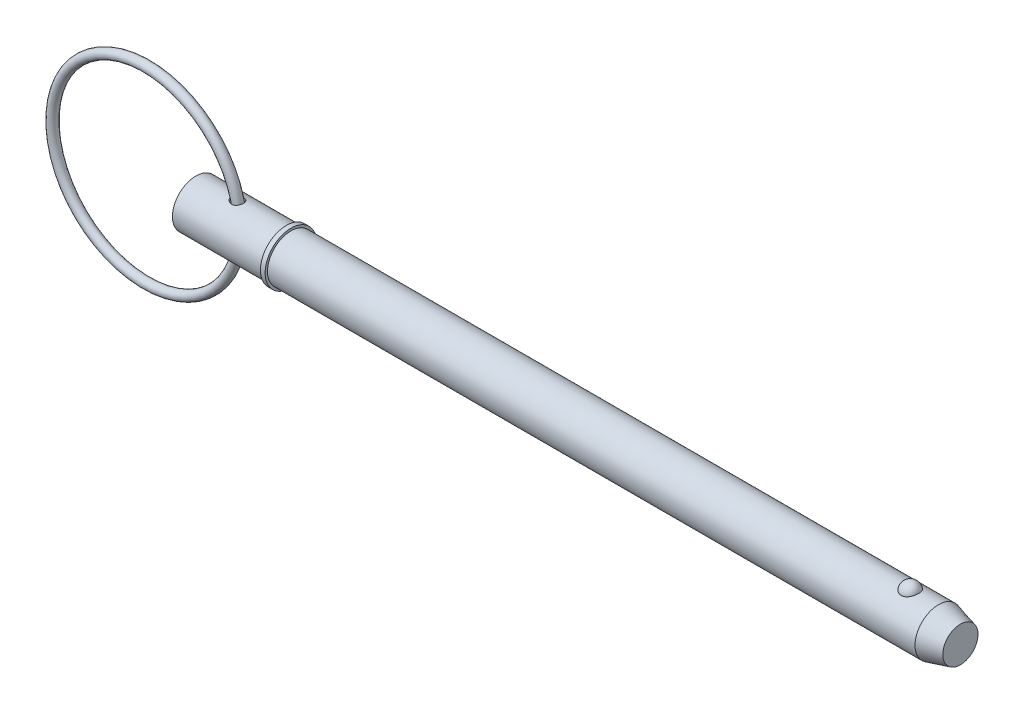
ISO-10303-21;
HEADER;
FILE_DESCRIPTION(('STEP AP214'),'2;1');
FILE_NAME('part.step','',(''),(''),'','','');
FILE_SCHEMA(('AUTOMOTIVE_DESIGN { 1 0 10303 214 1 1 1 1 }'));
ENDSEC;
DATA;
#1=APPLICATION_CONTEXT('core data for automotive mechanical design processes');
#2=APPLICATION_PROTOCOL_DEFINITION('international standard','automotive_design',2000,#1);
#3=PRODUCT_CONTEXT('',#1,'mechanical');
#4=PRODUCT('Part','Part','',(#3));
#5=PRODUCT_RELATED_PRODUCT_CATEGORY('part','',(#4));
#6=PRODUCT_DEFINITION_FORMATION('','',#4);
#7=PRODUCT_DEFINITION_CONTEXT('part definition',#1,'design');
#8=PRODUCT_DEFINITION('design','',#6,#7);
#9=PRODUCT_DEFINITION_SHAPE('','',#8);
#10=(LENGTH_UNIT() NAMED_UNIT(*) SI_UNIT(.MILLI.,.METRE.));
#11=(NAMED_UNIT(*) PLANE_ANGLE_UNIT() SI_UNIT($,.RADIAN.));
#12=(NAMED_UNIT(*) SI_UNIT($,.STERADIAN.) SOLID_ANGLE_UNIT());
#13=UNCERTAINTY_MEASURE_WITH_UNIT(LENGTH_MEASURE(1.E-05),#10,'distance_accuracy_value','');
#14=(GEOMETRIC_REPRESENTATION_CONTEXT(3) GLOBAL_UNCERTAINTY_ASSIGNED_CONTEXT((#13)) GLOBAL_UNIT_ASSIGNED_CONTEXT((#10,
#11,#12)) REPRESENTATION_CONTEXT('',''));
#15=CARTESIAN_POINT('',(0.,0.,0.));
#16=DIRECTION('',(0.,0.,1.));
#17=DIRECTION('',(1.,0.,0.));
#18=AXIS2_PLACEMENT_3D('',#15,#16,#17);
#19=CARTESIAN_POINT('',(-13.3798047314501,0.,0.));
#20=DIRECTION('',(0.,0.,1.));
#21=DIRECTION('',(1.,0.,0.));
#22=AXIS2_PLACEMENT_3D('',#19,#20,#21);
#23=TOROIDAL_SURFACE('',#22,25.4,1.27);
#24=CARTESIAN_POINT('',(13.2901952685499,0.,0.));
#25=VERTEX_POINT('',#24);
#26=VERTEX_LOOP('',#25);
#27=FACE_BOUND('',#26,.T.);
#28=ADVANCED_FACE('P0_F12',(#27),#23,.T.);
#29=CLOSED_SHELL('',(#28));
#30=MANIFOLD_SOLID_BREP('P0_B1',#29);
#31=CARTESIAN_POINT('',(0.,0.,0.));
#32=DIRECTION('',(1.,0.,0.));
#33=DIRECTION('',(0.,0.,-1.));
#34=AXIS2_PLACEMENT_3D('',#31,#32,#33);
#35=CYLINDRICAL_SURFACE('',#34,6.35);
#36=CARTESIAN_POINT('',(9.67500140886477,6.32698634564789,-0.540133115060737));
#37=CARTESIAN_POINT('',(9.70878953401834,6.3197498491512,-0.624879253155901));
#38=CARTESIAN_POINT('',(9.75028044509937,6.31105328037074,-0.706504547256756));
#39=CARTESIAN_POINT('',(9.84659255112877,6.29180070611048,-0.861319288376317));
#40=CARTESIAN_POINT('',(9.90144039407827,6.28124099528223,-0.934491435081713));
#41=CARTESIAN_POINT('',(10.021999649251,6.25949497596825,-1.0704877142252));
#42=CARTESIAN_POINT('',(10.0876589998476,6.2483118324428,-1.13335868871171));
#43=CARTESIAN_POINT('',(10.2280180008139,6.22641783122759,-1.24805262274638));
#44=CARTESIAN_POINT('',(10.3027159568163,6.21570688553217,-1.29987764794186));
#45=CARTESIAN_POINT('',(10.4650889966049,6.19509606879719,-1.39492899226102));
#46=CARTESIAN_POINT('',(10.5533142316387,6.1853135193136,-1.4372443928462));
#47=CARTESIAN_POINT('',(10.7357818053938,6.16871128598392,-1.50691441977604));
#48=CARTESIAN_POINT('',(10.8300253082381,6.16189217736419,-1.53426614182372));
#49=CARTESIAN_POINT('',(11.0227953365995,6.15211299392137,-1.57302798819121));
#50=CARTESIAN_POINT('',(11.1213511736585,6.14918579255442,-1.58430237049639));
#51=CARTESIAN_POINT('',(11.3189518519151,6.1478413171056,-1.58951619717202));
#52=CARTESIAN_POINT('',(11.417996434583,6.14942187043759,-1.58346399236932));
#53=CARTESIAN_POINT('',(11.6070859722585,6.15678569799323,-1.55457003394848));
#54=CARTESIAN_POINT('',(11.6973059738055,6.16229943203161,-1.53280404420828));
#55=CARTESIAN_POINT('',(11.8723373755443,6.17663058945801,-1.4739892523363));
#56=CARTESIAN_POINT('',(11.9571502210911,6.185447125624,-1.43694455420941));
#57=CARTESIAN_POINT('',(12.1146737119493,6.20482821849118,-1.35072170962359));
#58=CARTESIAN_POINT('',(12.1877743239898,6.21528554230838,-1.30222952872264));
#59=CARTESIAN_POINT('',(12.3246187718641,6.23705116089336,-1.19362916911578));
#60=CARTESIAN_POINT('',(12.3883628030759,6.24835943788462,-1.1335212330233));
#61=CARTESIAN_POINT('',(12.5046662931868,6.27053957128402,-1.00357204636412));
#62=CARTESIAN_POINT('',(12.5572571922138,6.28141258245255,-0.933759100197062));
#63=CARTESIAN_POINT('',(12.6502125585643,6.30157953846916,-0.786214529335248));
#64=CARTESIAN_POINT('',(12.6905764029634,6.31087340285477,-0.708482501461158));
#65=CARTESIAN_POINT('',(12.7585531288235,6.32699259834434,-0.546246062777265));
#66=CARTESIAN_POINT('',(12.7860022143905,6.33378599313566,-0.46166981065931));
#67=CARTESIAN_POINT('',(12.8267605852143,6.34401050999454,-0.288980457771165));
#68=CARTESIAN_POINT('',(12.8400695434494,6.34744155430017,-0.200867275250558));
#69=CARTESIAN_POINT('',(12.8522644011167,6.35058177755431,-0.023194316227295));
#70=CARTESIAN_POINT('',(12.8510870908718,6.35027464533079,0.0663700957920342));
#71=CARTESIAN_POINT('',(12.8341831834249,6.34593169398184,0.244024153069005));
#72=CARTESIAN_POINT('',(12.8184563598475,6.341895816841,0.332113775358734));
#73=CARTESIAN_POINT('',(12.7728208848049,6.33052992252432,0.504322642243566));
#74=CARTESIAN_POINT('',(12.7429114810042,6.32319973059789,0.58844167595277));
#75=CARTESIAN_POINT('',(12.6696162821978,6.30604116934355,0.750316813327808));
#76=CARTESIAN_POINT('',(12.6262302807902,6.29621276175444,0.828072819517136));
#77=CARTESIAN_POINT('',(12.5270856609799,6.27515240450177,0.974918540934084));
#78=CARTESIAN_POINT('',(12.4713403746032,6.26392197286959,1.04401746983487));
#79=CARTESIAN_POINT('',(12.3488662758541,6.24131002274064,1.1716478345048));
#80=CARTESIAN_POINT('',(12.2821384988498,6.22992851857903,1.23018026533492));
#81=CARTESIAN_POINT('',(12.1401870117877,6.20841765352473,1.33449214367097));
#82=CARTESIAN_POINT('',(12.0650507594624,6.19827734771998,1.38038832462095));
#83=CARTESIAN_POINT('',(11.9079044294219,6.18026478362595,1.45892404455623));
#84=CARTESIAN_POINT('',(11.8258951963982,6.17239224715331,1.49156520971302));
#85=CARTESIAN_POINT('',(11.6581736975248,6.15982613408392,1.54263810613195));
#86=CARTESIAN_POINT('',(11.572502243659,6.15510409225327,1.56119728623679));
#87=CARTESIAN_POINT('',(11.3991899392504,6.14916283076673,1.58443707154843));
#88=CARTESIAN_POINT('',(11.3115488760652,6.14794399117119,1.58911617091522));
#89=CARTESIAN_POINT('',(11.1345547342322,6.14904466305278,1.58485137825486));
#90=CARTESIAN_POINT('',(11.0452104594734,6.15144894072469,1.5755811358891));
#91=CARTESIAN_POINT('',(10.8691479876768,6.15957601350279,1.54349959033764));
#92=CARTESIAN_POINT('',(10.782430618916,6.16529984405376,1.52068406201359));
#93=CARTESIAN_POINT('',(10.6082848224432,6.17983892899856,1.4605156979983));
#94=CARTESIAN_POINT('',(10.5211557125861,6.1888262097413,1.42233764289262));
#95=CARTESIAN_POINT('',(10.3542377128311,6.20874782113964,1.33268652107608));
#96=CARTESIAN_POINT('',(10.2744521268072,6.21968302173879,1.28120750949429));
#97=CARTESIAN_POINT('',(10.120854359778,6.24282707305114,1.16334748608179));
#98=CARTESIAN_POINT('',(10.0474902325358,6.25507146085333,1.09638652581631));
#99=CARTESIAN_POINT('',(9.9136869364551,6.27890019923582,0.950453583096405));
#100=CARTESIAN_POINT('',(9.85324511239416,6.29048468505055,0.871484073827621));
#101=CARTESIAN_POINT('',(9.75037543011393,6.31102161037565,0.707140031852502));
#102=CARTESIAN_POINT('',(9.70726585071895,6.32006820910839,0.622206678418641));
#103=CARTESIAN_POINT('',(9.63775895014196,6.33497125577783,0.445490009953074));
#104=CARTESIAN_POINT('',(9.61134627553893,6.34083063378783,0.35371307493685));
#105=CARTESIAN_POINT('',(9.57891955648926,6.34807071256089,0.177220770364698));
#106=CARTESIAN_POINT('',(9.57093524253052,6.3498832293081,0.0928817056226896));
#107=CARTESIAN_POINT('',(9.56994851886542,6.35010532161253,-0.0758268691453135));
#108=CARTESIAN_POINT('',(9.57692695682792,6.34851924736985,-0.160196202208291));
#109=CARTESIAN_POINT('',(9.59985709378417,6.34339435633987,-0.294043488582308));
#110=CARTESIAN_POINT('',(9.61128951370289,6.34084912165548,-0.344385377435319));
#111=CARTESIAN_POINT('',(9.63933183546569,6.33468615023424,-0.443526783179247));
#112=CARTESIAN_POINT('',(9.65594100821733,6.33106856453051,-0.492326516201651));
#113=CARTESIAN_POINT('',(9.67500140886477,6.32698634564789,-0.540133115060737));
#114=B_SPLINE_CURVE_WITH_KNOTS('',3,(#36,#37,#38,#39,#40,#41,#42,#43,#44,#45,#46,#47,#48,#49,
#50,#51,#52,#53,#54,#55,#56,#57,#58,#59,#60,#61,#62,#63,#64,#65,#66,#67,#68,#69,#70,#71,#72,#73,
#74,#75,#76,#77,#78,#79,#80,#81,#82,#83,#84,#85,#86,#87,#88,#89,#90,#91,#92,#93,#94,#95,#96,#97,
#98,#99,#100,#101,#102,#103,#104,#105,#106,#107,#108,#109,#110,#111,#112,#113),.UNSPECIFIED.,
.T.,.F.,(4,2,2,2,2,2,2,2,2,2,2,2,2,2,2,2,2,2,2,2,2,2,2,2,2,2,2,2,2,2,2,2,2,2,2,2,2,2,4),(0.,
0.274348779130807,0.549249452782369,0.822863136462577,1.09642560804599,1.39007706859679,
1.68378550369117,1.97995934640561,2.27599046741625,2.55347281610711,2.83088067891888,
3.09465189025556,3.35841759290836,3.62142956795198,3.88445494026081,4.1507318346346,
4.4170148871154,4.68446025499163,4.95190978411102,5.21937350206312,5.48684131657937,
5.75402200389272,6.02117751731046,6.28577524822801,6.55034050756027,6.81248178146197,
7.0746514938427,7.34305086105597,7.61153399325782,7.89692981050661,8.18245340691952,
8.48120635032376,8.77989784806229,9.06530254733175,9.35044442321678,9.60331609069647,
9.85586427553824,10.010650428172,10.1654147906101),.UNSPECIFIED.);
#115=CARTESIAN_POINT('',(9.67500140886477,6.32698634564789,-0.540133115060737));
#116=VERTEX_POINT('',#115);
#117=EDGE_CURVE('P1_E42',#116,#116,#114,.T.);
#118=ORIENTED_EDGE('',*,*,#117,.T.);
#119=EDGE_LOOP('',(#118));
#120=FACE_BOUND('',#119,.T.);
#121=CARTESIAN_POINT('',(0.,0.,0.));
#122=DIRECTION('',(1.,0.,0.));
#123=DIRECTION('',(0.,0.,-1.));
#124=AXIS2_PLACEMENT_3D('',#121,#122,#123);
#125=CIRCLE('',#124,6.35);
#126=CARTESIAN_POINT('',(0.,0.,-6.35));
#127=VERTEX_POINT('',#126);
#128=EDGE_CURVE('P1_E9',#127,#127,#125,.T.);
#129=ORIENTED_EDGE('',*,*,#128,.T.);
#130=EDGE_LOOP('',(#129));
#131=FACE_BOUND('',#130,.T.);
#132=CARTESIAN_POINT('',(24.43,0.,0.));
#133=DIRECTION('',(1.,0.,0.));
#134=DIRECTION('',(0.,0.,-1.));
#135=AXIS2_PLACEMENT_3D('',#132,#133,#134);
#136=CIRCLE('',#135,6.35);
#137=CARTESIAN_POINT('',(24.43,0.,-6.35));
#138=VERTEX_POINT('',#137);
#139=EDGE_CURVE('P1_E25',#138,#138,#136,.T.);
#140=ORIENTED_EDGE('',*,*,#139,.F.);
#141=EDGE_LOOP('',(#140));
#142=FACE_BOUND('',#141,.T.);
#143=CARTESIAN_POINT('',(9.67500140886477,-6.32698634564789,-0.540133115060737));
#144=CARTESIAN_POINT('',(9.64544894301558,-6.33331515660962,-0.466002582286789));
#145=CARTESIAN_POINT('',(9.62177180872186,-6.33852974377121,-0.389437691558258));
#146=CARTESIAN_POINT('',(9.58727043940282,-6.34619174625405,-0.233330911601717));
#147=CARTESIAN_POINT('',(9.57644043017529,-6.34864040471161,-0.153790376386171));
#148=CARTESIAN_POINT('',(9.56819517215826,-6.3505010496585,0.00612071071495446));
#149=CARTESIAN_POINT('',(9.57079639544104,-6.34990930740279,0.0864921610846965));
#150=CARTESIAN_POINT('',(9.58930797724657,-6.3457478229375,0.245607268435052));
#151=CARTESIAN_POINT('',(9.60522046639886,-6.34217760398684,0.324350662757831));
#152=CARTESIAN_POINT('',(9.64931570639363,-6.3324977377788,0.47727605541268));
#153=CARTESIAN_POINT('',(9.67737525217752,-6.32641361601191,0.551495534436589));
#154=CARTESIAN_POINT('',(9.74451510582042,-6.31231128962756,0.694551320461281));
#155=CARTESIAN_POINT('',(9.78359827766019,-6.30429258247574,0.763386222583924));
#156=CARTESIAN_POINT('',(9.87474700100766,-6.28638332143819,0.899414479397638));
#157=CARTESIAN_POINT('',(9.92757481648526,-6.27639669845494,0.966083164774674));
#158=CARTESIAN_POINT('',(10.042675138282,-6.25596164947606,1.09061181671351));
#159=CARTESIAN_POINT('',(10.1049521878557,-6.24551300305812,1.14846751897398));
#160=CARTESIAN_POINT('',(10.2445505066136,-6.22397505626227,1.26024641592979));
#161=CARTESIAN_POINT('',(10.3227711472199,-6.2129394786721,1.31305951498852));
#162=CARTESIAN_POINT('',(10.4867924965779,-6.19263757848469,1.40570084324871));
#163=CARTESIAN_POINT('',(10.5725962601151,-6.18337197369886,1.44552380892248));
#164=CARTESIAN_POINT('',(10.7543302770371,-6.16725983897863,1.51283687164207));
#165=CARTESIAN_POINT('',(10.8505554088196,-6.16056505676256,1.53957358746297));
#166=CARTESIAN_POINT('',(11.0463546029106,-6.15127671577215,1.57628137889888));
#167=CARTESIAN_POINT('',(11.1459276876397,-6.14868197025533,1.58625730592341));
#168=CARTESIAN_POINT('',(11.3414257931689,-6.14810798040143,1.58848000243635));
#169=CARTESIAN_POINT('',(11.4373417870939,-6.14995283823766,1.58140242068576));
#170=CARTESIAN_POINT('',(11.6262783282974,-6.1577972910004,1.55057566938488));
#171=CARTESIAN_POINT('',(11.719300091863,-6.16379511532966,1.52683360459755));
#172=CARTESIAN_POINT('',(11.8934223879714,-6.17873566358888,1.46514575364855));
#173=CARTESIAN_POINT('',(11.9749048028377,-6.18746207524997,1.42822144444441));
#174=CARTESIAN_POINT('',(12.1301362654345,-6.20693584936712,1.3410564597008));
#175=CARTESIAN_POINT('',(12.2038861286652,-6.21768299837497,1.29081719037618));
#176=CARTESIAN_POINT('',(12.3399792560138,-6.23970077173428,1.17972764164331));
#177=CARTESIAN_POINT('',(12.4025430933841,-6.25095401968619,1.11914355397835));
#178=CARTESIAN_POINT('',(12.5166805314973,-6.27296916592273,0.988307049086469));
#179=CARTESIAN_POINT('',(12.568253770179,-6.28373104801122,0.918054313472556));
#180=CARTESIAN_POINT('',(12.6596230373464,-6.3037060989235,0.769081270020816));
#181=CARTESIAN_POINT('',(12.6992956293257,-6.31290263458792,0.690283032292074));
#182=CARTESIAN_POINT('',(12.7652258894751,-6.32862394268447,0.527011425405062));
#183=CARTESIAN_POINT('',(12.7914829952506,-6.33514860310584,0.442537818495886));
#184=CARTESIAN_POINT('',(12.8301436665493,-6.34487485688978,0.269505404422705));
#185=CARTESIAN_POINT('',(12.8424230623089,-6.34804664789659,0.180917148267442));
#186=CARTESIAN_POINT('',(12.8524214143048,-6.35062347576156,0.00286829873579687));
#187=CARTESIAN_POINT('',(12.8501402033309,-6.35002846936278,-0.0865923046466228));
#188=CARTESIAN_POINT('',(12.8310619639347,-6.34513332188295,-0.263931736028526));
#189=CARTESIAN_POINT('',(12.8142517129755,-6.34082980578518,-0.35180904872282));
#190=CARTESIAN_POINT('',(12.7664911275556,-6.32897674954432,-0.523406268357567));
#191=CARTESIAN_POINT('',(12.7355404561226,-6.3214271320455,-0.607126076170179));
#192=CARTESIAN_POINT('',(12.6602298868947,-6.30390232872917,-0.768030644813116));
#193=CARTESIAN_POINT('',(12.6158695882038,-6.29392707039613,-0.84521521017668));
#194=CARTESIAN_POINT('',(12.5148171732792,-6.2726521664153,-0.990836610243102));
#195=CARTESIAN_POINT('',(12.4581254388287,-6.26135256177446,-1.05927371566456));
#196=CARTESIAN_POINT('',(12.33416419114,-6.2387572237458,-1.18510935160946));
#197=CARTESIAN_POINT('',(12.2669484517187,-6.22746174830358,-1.24256086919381));
#198=CARTESIAN_POINT('',(12.1235592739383,-6.20610255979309,-1.34519464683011));
#199=CARTESIAN_POINT('',(12.0473871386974,-6.19603866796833,-1.39037868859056));
#200=CARTESIAN_POINT('',(11.8892714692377,-6.17839642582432,-1.46678006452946));
#201=CARTESIAN_POINT('',(11.8074126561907,-6.17078838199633,-1.49816605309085));
#202=CARTESIAN_POINT('',(11.6394563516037,-6.15869606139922,-1.54712759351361));
#203=CARTESIAN_POINT('',(11.5533589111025,-6.15421174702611,-1.56470331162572));
#204=CARTESIAN_POINT('',(11.3789660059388,-6.14876652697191,-1.58596734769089));
#205=CARTESIAN_POINT('',(11.2906621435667,-6.1478222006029,-1.58959032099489));
#206=CARTESIAN_POINT('',(11.1146029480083,-6.149490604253,-1.58312110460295));
#207=CARTESIAN_POINT('',(11.0268477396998,-6.1521041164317,-1.57302589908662));
#208=CARTESIAN_POINT('',(10.8498668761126,-6.16071031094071,-1.53898332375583));
#209=CARTESIAN_POINT('',(10.7607726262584,-6.16685908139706,-1.51439468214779));
#210=CARTESIAN_POINT('',(10.5876521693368,-6.18189031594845,-1.45181305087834));
#211=CARTESIAN_POINT('',(10.5036282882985,-6.19077402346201,-1.41381396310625));
#212=CARTESIAN_POINT('',(10.3374228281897,-6.2109378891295,-1.32252480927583));
#213=CARTESIAN_POINT('',(10.255708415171,-6.2223355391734,-1.26840756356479));
#214=CARTESIAN_POINT('',(10.1025645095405,-6.24580740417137,-1.14725208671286));
#215=CARTESIAN_POINT('',(10.0311354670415,-6.25788164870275,-1.08021329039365));
#216=CARTESIAN_POINT('',(9.90472699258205,-6.2806176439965,-0.938710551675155));
#217=CARTESIAN_POINT('',(9.84904456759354,-6.29132066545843,-0.864883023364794));
#218=CARTESIAN_POINT('',(9.75129345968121,-6.31084098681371,-0.708496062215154));
#219=CARTESIAN_POINT('',(9.70921094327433,-6.31966019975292,-0.625945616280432));
#220=CARTESIAN_POINT('',(9.67500140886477,-6.32698634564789,-0.540133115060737));
#221=B_SPLINE_CURVE_WITH_KNOTS('',3,(#143,#144,#145,#146,#147,#148,#149,#150,#151,#152,#153,
#154,#155,#156,#157,#158,#159,#160,#161,#162,#163,#164,#165,#166,#167,#168,#169,#170,#171,#172,
#173,#174,#175,#176,#177,#178,#179,#180,#181,#182,#183,#184,#185,#186,#187,#188,#189,#190,#191,
#192,#193,#194,#195,#196,#197,#198,#199,#200,#201,#202,#203,#204,#205,#206,#207,#208,#209,#210,
#211,#212,#213,#214,#215,#216,#217,#218,#219,#220),.UNSPECIFIED.,.T.,.F.,(4,2,2,2,2,2,2,2,2,2,2,
2,2,2,2,2,2,2,2,2,2,2,2,2,2,2,2,2,2,2,2,2,2,2,2,2,2,2,4),(0.,0.239871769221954,
0.479635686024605,0.719693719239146,0.959790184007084,1.19750645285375,1.43528453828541,
1.69117930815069,1.94719750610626,2.23102979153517,2.51497694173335,2.81376497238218,
3.11246650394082,3.39952951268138,3.68647020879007,3.95479420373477,4.22308987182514,
4.48530700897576,4.74753278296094,5.01239119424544,5.27726070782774,5.54446524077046,
5.81167284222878,6.07912387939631,6.34658129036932,6.61404669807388,6.88150382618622,
7.14763644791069,7.41373039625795,7.67647472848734,7.93921589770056,8.20318607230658,
8.46721428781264,8.74390821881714,9.02072813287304,9.31537622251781,9.61003720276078,
9.88799314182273,10.1656654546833),.UNSPECIFIED.);
#222=CARTESIAN_POINT('',(9.67500140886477,-6.32698634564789,-0.540133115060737));
#223=VERTEX_POINT('',#222);
#224=EDGE_CURVE('P1_E17',#223,#223,#221,.T.);
#225=ORIENTED_EDGE('',*,*,#224,.T.);
#226=EDGE_LOOP('',(#225));
#227=FACE_BOUND('',#226,.T.);
#228=ADVANCED_FACE('P1_F13',(#120,#131,#142,#227),#35,.T.);
#229=CARTESIAN_POINT('',(0.,0.,0.));
#230=DIRECTION('',(1.,0.,0.));
#231=DIRECTION('',(0.,0.,-1.));
#232=AXIS2_PLACEMENT_3D('',#229,#230,#231);
#233=CYLINDRICAL_SURFACE('',#232,6.35);
#234=CARTESIAN_POINT('',(200.755369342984,0.,0.));
#235=DIRECTION('',(1.,0.,0.));
#236=DIRECTION('',(0.,0.,-1.));
#237=AXIS2_PLACEMENT_3D('',#234,#235,#236);
#238=CIRCLE('',#237,6.35);
#239=CARTESIAN_POINT('',(200.755369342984,0.,-6.35));
#240=VERTEX_POINT('',#239);
#241=EDGE_CURVE('P1_E99',#240,#240,#238,.T.);
#242=ORIENTED_EDGE('',*,*,#241,.F.);
#243=EDGE_LOOP('',(#242));
#244=FACE_BOUND('',#243,.T.);
#245=CARTESIAN_POINT('',(25.7,0.,0.));
#246=DIRECTION('',(1.,0.,0.));
#247=DIRECTION('',(0.,0.,-1.));
#248=AXIS2_PLACEMENT_3D('',#245,#246,#247);
#249=CIRCLE('',#248,6.35);
#250=CARTESIAN_POINT('',(25.7,0.,-6.35));
#251=VERTEX_POINT('',#250);
#252=EDGE_CURVE('P1_E96',#251,#251,#249,.T.);
#253=ORIENTED_EDGE('',*,*,#252,.T.);
#254=EDGE_LOOP('',(#253));
#255=FACE_BOUND('',#254,.T.);
#256=CARTESIAN_POINT('',(193.130021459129,5.87502187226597,2.40969251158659));
#257=CARTESIAN_POINT('',(193.005030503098,5.87501645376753,2.40969773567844));
#258=CARTESIAN_POINT('',(192.880080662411,5.87916061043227,2.39967292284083));
#259=CARTESIAN_POINT('',(192.633909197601,5.8952311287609,2.35991730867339));
#260=CARTESIAN_POINT('',(192.512686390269,5.90715499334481,2.33019283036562));
#261=CARTESIAN_POINT('',(192.277517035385,5.93739567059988,2.25201402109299));
#262=CARTESIAN_POINT('',(192.163560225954,5.95570321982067,2.20358681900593));
#263=CARTESIAN_POINT('',(191.94557352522,5.9967206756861,2.08937987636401));
#264=CARTESIAN_POINT('',(191.841545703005,6.01943149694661,2.02359652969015));
#265=CARTESIAN_POINT('',(191.642943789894,6.06760647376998,1.87428969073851));
#266=CARTESIAN_POINT('',(191.548726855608,6.09313095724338,1.79031110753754));
#267=CARTESIAN_POINT('',(191.375255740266,6.14375873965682,1.60800178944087));
#268=CARTESIAN_POINT('',(191.296004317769,6.16886196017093,1.50966841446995));
#269=CARTESIAN_POINT('',(191.150845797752,6.21724600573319,1.29645884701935));
#270=CARTESIAN_POINT('',(191.085688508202,6.24039621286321,1.18104158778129));
#271=CARTESIAN_POINT('',(190.974703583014,6.28117277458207,0.940351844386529));
#272=CARTESIAN_POINT('',(190.928877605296,6.29879865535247,0.81507851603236));
#273=CARTESIAN_POINT('',(190.857023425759,6.32692073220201,0.556494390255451));
#274=CARTESIAN_POINT('',(190.831249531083,6.33732517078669,0.423102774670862));
#275=CARTESIAN_POINT('',(190.800988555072,6.34957673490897,0.15354272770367));
#276=CARTESIAN_POINT('',(190.796500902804,6.35142408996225,0.0173743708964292));
#277=CARTESIAN_POINT('',(190.808865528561,6.34638925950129,-0.253036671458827));
#278=CARTESIAN_POINT('',(190.825594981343,6.33955731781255,-0.387285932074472));
#279=CARTESIAN_POINT('',(190.879843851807,6.31794129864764,-0.650851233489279));
#280=CARTESIAN_POINT('',(190.917363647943,6.30315707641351,-0.780167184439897));
#281=CARTESIAN_POINT('',(191.012500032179,6.26711642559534,-1.03041949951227));
#282=CARTESIAN_POINT('',(191.070143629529,6.24585130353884,-1.1513443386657));
#283=CARTESIAN_POINT('',(191.204352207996,6.19905619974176,-1.38129800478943));
#284=CARTESIAN_POINT('',(191.280918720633,6.17352587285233,-1.49032586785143));
#285=CARTESIAN_POINT('',(191.451753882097,6.12080227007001,-1.69393164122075));
#286=CARTESIAN_POINT('',(191.546100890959,6.09360200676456,-1.78844209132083));
#287=CARTESIAN_POINT('',(191.750119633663,6.04070434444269,-1.95970536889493));
#288=CARTESIAN_POINT('',(191.859790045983,6.01500681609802,-2.03645972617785));
#289=CARTESIAN_POINT('',(192.089187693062,5.96867714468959,-2.16845644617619));
#290=CARTESIAN_POINT('',(192.208652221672,5.94794910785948,-2.22412062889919));
#291=CARTESIAN_POINT('',(192.456218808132,5.91340580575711,-2.31440992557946));
#292=CARTESIAN_POINT('',(192.584317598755,5.8995879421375,-2.3490429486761));
#293=CARTESIAN_POINT('',(192.838582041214,5.88111049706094,-2.39491590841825));
#294=CARTESIAN_POINT('',(192.964520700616,5.876025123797,-2.40724512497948));
#295=CARTESIAN_POINT('',(193.216786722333,5.87428980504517,-2.41147867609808));
#296=CARTESIAN_POINT('',(193.343114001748,5.87763817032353,-2.40338710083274));
#297=CARTESIAN_POINT('',(193.588417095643,5.89212921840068,-2.36762715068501));
#298=CARTESIAN_POINT('',(193.707499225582,5.90302431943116,-2.34058030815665));
#299=CARTESIAN_POINT('',(193.93924472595,5.93113752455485,-2.26839066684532));
#300=CARTESIAN_POINT('',(194.051907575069,5.94835614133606,-2.22324640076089));
#301=CARTESIAN_POINT('',(194.270400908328,5.98773016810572,-2.11493806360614));
#302=CARTESIAN_POINT('',(194.376028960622,6.00998499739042,-2.05140269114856));
#303=CARTESIAN_POINT('',(194.575300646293,6.05690144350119,-1.90842705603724));
#304=CARTESIAN_POINT('',(194.668941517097,6.08156361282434,-1.82898313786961));
#305=CARTESIAN_POINT('',(194.846675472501,6.13211715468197,-1.65182429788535));
#306=CARTESIAN_POINT('',(194.930055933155,6.15800825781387,-1.55339381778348));
#307=CARTESIAN_POINT('',(195.079790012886,6.20712834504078,-1.34374214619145));
#308=CARTESIAN_POINT('',(195.146140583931,6.23035685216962,-1.23251867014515));
#309=CARTESIAN_POINT('',(195.262345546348,6.27251177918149,-0.996447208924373));
#310=CARTESIAN_POINT('',(195.311607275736,6.29127762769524,-0.871278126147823));
#311=CARTESIAN_POINT('',(195.389614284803,6.3215862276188,-0.613870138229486));
#312=CARTESIAN_POINT('',(195.418359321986,6.33312889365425,-0.481631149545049));
#313=CARTESIAN_POINT('',(195.45477058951,6.34782349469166,-0.213672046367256));
#314=CARTESIAN_POINT('',(195.462413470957,6.35096613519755,-0.0779482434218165));
#315=CARTESIAN_POINT('',(195.456395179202,6.34851322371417,0.192943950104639));
#316=CARTESIAN_POINT('',(195.442734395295,6.3429178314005,0.328112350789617));
#317=CARTESIAN_POINT('',(195.39450361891,6.32360512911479,0.593406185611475));
#318=CARTESIAN_POINT('',(195.360031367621,6.30992579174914,0.7235521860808));
#319=CARTESIAN_POINT('',(195.270953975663,6.27586325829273,0.975834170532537));
#320=CARTESIAN_POINT('',(195.21634761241,6.25547965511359,1.09796966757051));
#321=CARTESIAN_POINT('',(195.08775879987,6.20998183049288,1.33148921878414));
#322=CARTESIAN_POINT('',(195.013674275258,6.18484288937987,1.44281227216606));
#323=CARTESIAN_POINT('',(194.847820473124,6.13258735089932,1.65087683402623));
#324=CARTESIAN_POINT('',(194.756051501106,6.10547078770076,1.74761859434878));
#325=CARTESIAN_POINT('',(194.557183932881,6.05235879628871,1.92350926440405));
#326=CARTESIAN_POINT('',(194.450133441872,6.0263601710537,2.00271146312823));
#327=CARTESIAN_POINT('',(194.223138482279,5.97843747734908,2.1415415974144));
#328=CARTESIAN_POINT('',(194.103191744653,5.95651412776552,2.20116608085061));
#329=CARTESIAN_POINT('',(193.844523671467,5.91812106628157,2.30250570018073));
#330=CARTESIAN_POINT('',(193.70506980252,5.90217533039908,2.34256795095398));
#331=CARTESIAN_POINT('',(193.420397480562,5.88063128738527,2.39615214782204));
#332=CARTESIAN_POINT('',(193.27518174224,5.8750281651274,2.40968644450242));
#333=CARTESIAN_POINT('',(193.130021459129,5.87502187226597,2.40969251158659));
#334=B_SPLINE_CURVE_WITH_KNOTS('',3,(#256,#257,#258,#259,#260,#261,#262,#263,#264,#265,#266,
#267,#268,#269,#270,#271,#272,#273,#274,#275,#276,#277,#278,#279,#280,#281,#282,#283,#284,#285,
#286,#287,#288,#289,#290,#291,#292,#293,#294,#295,#296,#297,#298,#299,#300,#301,#302,#303,#304,
#305,#306,#307,#308,#309,#310,#311,#312,#313,#314,#315,#316,#317,#318,#319,#320,#321,#322,#323,
#324,#325,#326,#327,#328,#329,#330,#331,#332,#333),.UNSPECIFIED.,.T.,.F.,(4,2,2,2,2,2,2,2,2,2,2,
2,2,2,2,2,2,2,2,2,2,2,2,2,2,2,2,2,2,2,2,2,2,2,2,2,2,2,4),(0.,0.374440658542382,
0.748761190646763,1.1225407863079,1.49639810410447,1.88098871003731,2.2656501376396,
2.6674110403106,3.06920639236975,3.47601794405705,3.88281858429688,4.28727498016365,
4.69173873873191,5.09674745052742,5.50178895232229,5.90865911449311,6.31549420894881,
6.71369855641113,7.11175305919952,7.48978077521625,7.86773278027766,8.23383886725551,
8.59997464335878,8.97409044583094,9.34829231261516,9.74122667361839,10.1342313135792,
10.5397522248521,10.9452779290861,11.3512521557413,11.7572189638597,12.1612938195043,
12.5653932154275,12.9716540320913,13.3779078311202,13.7829098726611,14.1879832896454,
14.6230486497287,15.0579114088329),.UNSPECIFIED.);
#335=CARTESIAN_POINT('',(193.130021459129,5.87502187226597,2.40969251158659));
#336=VERTEX_POINT('',#335);
#337=EDGE_CURVE('P1_E34',#336,#336,#334,.T.);
#338=ORIENTED_EDGE('',*,*,#337,.T.);
#339=EDGE_LOOP('',(#338));
#340=FACE_BOUND('',#339,.T.);
#341=ADVANCED_FACE('P1_F46',(#244,#255,#340),#233,.T.);
#342=CARTESIAN_POINT('',(0.,0.,0.));
#343=DIRECTION('',(-1.,0.,0.));
#344=DIRECTION('',(0.,0.,1.));
#345=AXIS2_PLACEMENT_3D('',#342,#343,#344);
#346=PLANE('',#345);
#347=ORIENTED_EDGE('',*,*,#128,.F.);
#348=EDGE_LOOP('',(#347));
#349=FACE_BOUND('',#348,.T.);
#350=ADVANCED_FACE('P1_F15',(#349),#346,.T.);
#351=CARTESIAN_POINT('',(24.43,6.35,0.));
#352=DIRECTION('',(-1.,0.,0.));
#353=DIRECTION('',(0.,0.,1.));
#354=AXIS2_PLACEMENT_3D('',#351,#352,#353);
#355=PLANE('',#354);
#356=ORIENTED_EDGE('',*,*,#139,.T.);
#357=EDGE_LOOP('',(#356));
#358=FACE_BOUND('',#357,.T.);
#359=CARTESIAN_POINT('',(24.43,0.,0.));
#360=DIRECTION('',(1.,0.,0.));
#361=DIRECTION('',(0.,0.,-1.));
#362=AXIS2_PLACEMENT_3D('',#359,#360,#361);
#363=CIRCLE('',#362,6.985);
#364=CARTESIAN_POINT('',(24.43,0.,-6.985));
#365=VERTEX_POINT('',#364);
#366=EDGE_CURVE('P1_E30',#365,#365,#363,.T.);
#367=ORIENTED_EDGE('',*,*,#366,.F.);
#368=EDGE_LOOP('',(#367));
#369=FACE_BOUND('',#368,.T.);
#370=ADVANCED_FACE('P1_F81',(#358,#369),#355,.T.);
#371=CARTESIAN_POINT('',(0.,0.,0.));
#372=DIRECTION('',(1.,0.,0.));
#373=DIRECTION('',(0.,0.,-1.));
#374=AXIS2_PLACEMENT_3D('',#371,#372,#373);
#375=CYLINDRICAL_SURFACE('',#374,6.985);
#376=ORIENTED_EDGE('',*,*,#366,.T.);
#377=EDGE_LOOP('',(#376));
#378=FACE_BOUND('',#377,.T.);
#379=CARTESIAN_POINT('',(25.7,0.,0.));
#380=DIRECTION('',(1.,0.,0.));
#381=DIRECTION('',(0.,0.,-1.));
#382=AXIS2_PLACEMENT_3D('',#379,#380,#381);
#383=CIRCLE('',#382,6.985);
#384=CARTESIAN_POINT('',(25.7,0.,-6.985));
#385=VERTEX_POINT('',#384);
#386=EDGE_CURVE('P1_E95',#385,#385,#383,.T.);
#387=ORIENTED_EDGE('',*,*,#386,.F.);
#388=EDGE_LOOP('',(#387));
#389=FACE_BOUND('',#388,.T.);
#390=ADVANCED_FACE('P1_F68',(#378,#389),#375,.T.);
#391=CARTESIAN_POINT('',(25.7,6.985,0.));
#392=DIRECTION('',(1.,0.,0.));
#393=DIRECTION('',(0.,0.,-1.));
#394=AXIS2_PLACEMENT_3D('',#391,#392,#393);
#395=PLANE('',#394);
#396=ORIENTED_EDGE('',*,*,#386,.T.);
#397=EDGE_LOOP('',(#396));
#398=FACE_BOUND('',#397,.T.);
#399=ORIENTED_EDGE('',*,*,#252,.F.);
#400=EDGE_LOOP('',(#399));
#401=FACE_BOUND('',#400,.T.);
#402=ADVANCED_FACE('P1_F62',(#398,#401),#395,.T.);
#403=CARTESIAN_POINT('',(206.68,0.,0.));
#404=DIRECTION('',(-1.,0.,0.));
#405=DIRECTION('',(0.,0.,1.));
#406=AXIS2_PLACEMENT_3D('',#403,#404,#405);
#407=CONICAL_SURFACE('',#406,4.76250000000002,0.26179938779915);
#408=ORIENTED_EDGE('',*,*,#241,.T.);
#409=EDGE_LOOP('',(#408));
#410=FACE_BOUND('',#409,.T.);
#411=CARTESIAN_POINT('',(206.68,0.,0.));
#412=DIRECTION('',(1.,0.,0.));
#413=DIRECTION('',(0.,0.,-1.));
#414=AXIS2_PLACEMENT_3D('',#411,#412,#413);
#415=CIRCLE('',#414,4.76250000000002);
#416=CARTESIAN_POINT('',(206.68,0.,-4.76250000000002));
#417=VERTEX_POINT('',#416);
#418=EDGE_CURVE('P1_E41',#417,#417,#415,.T.);
#419=ORIENTED_EDGE('',*,*,#418,.F.);
#420=EDGE_LOOP('',(#419));
#421=FACE_BOUND('',#420,.T.);
#422=ADVANCED_FACE('P1_F59',(#410,#421),#407,.T.);
#423=CARTESIAN_POINT('',(206.68,4.76250000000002,0.));
#424=DIRECTION('',(1.,0.,0.));
#425=DIRECTION('',(0.,0.,-1.));
#426=AXIS2_PLACEMENT_3D('',#423,#424,#425);
#427=PLANE('',#426);
#428=ORIENTED_EDGE('',*,*,#418,.T.);
#429=EDGE_LOOP('',(#428));
#430=FACE_BOUND('',#429,.T.);
#431=ADVANCED_FACE('P1_F55',(#430),#427,.T.);
#432=CARTESIAN_POINT('',(193.130021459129,5.715,0.));
#433=DIRECTION('',(-1.,0.,0.));
#434=DIRECTION('',(0.,1.,0.));
#435=AXIS2_PLACEMENT_3D('',#432,#433,#434);
#436=SPHERICAL_SURFACE('',#435,2.415);
#437=ORIENTED_EDGE('',*,*,#337,.F.);
#438=EDGE_LOOP('',(#437));
#439=FACE_BOUND('',#438,.T.);
#440=ADVANCED_FACE('P1_F50',(#439),#436,.T.);
#441=CARTESIAN_POINT('',(-13.3798047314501,0.,0.));
#442=DIRECTION('',(0.,0.,1.));
#443=DIRECTION('',(1.,0.,0.));
#444=AXIS2_PLACEMENT_3D('',#441,#442,#443);
#445=TOROIDAL_SURFACE('',#444,25.4,1.5875);
#446=ORIENTED_EDGE('',*,*,#224,.F.);
#447=EDGE_LOOP('',(#446));
#448=FACE_BOUND('',#447,.T.);
#449=ORIENTED_EDGE('',*,*,#117,.F.);
#450=EDGE_LOOP('',(#449));
#451=FACE_BOUND('',#450,.T.);
#452=ADVANCED_FACE('P1_F54',(#448,#451),#445,.F.);
#453=CLOSED_SHELL('',(#228,#341,#350,#370,#390,#402,#422,#431,#440,#452));
#454=MANIFOLD_SOLID_BREP('P1_B1',#453);
#455=ADVANCED_BREP_SHAPE_REPRESENTATION('',(#18,#30,#454),#14);
#456=SHAPE_DEFINITION_REPRESENTATION(#9,#455);
ENDSEC;
END-ISO-10303-21;
